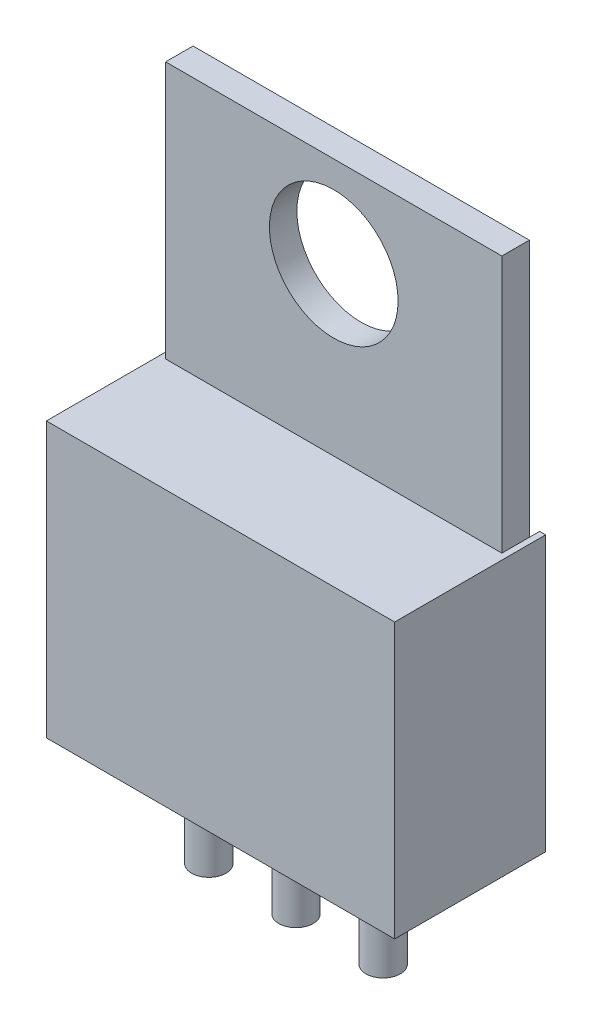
ISO-10303-21;
HEADER;
FILE_DESCRIPTION(('STEP AP214'),'2;1');
FILE_NAME('part.step','',(''),(''),'','','');
FILE_SCHEMA(('AUTOMOTIVE_DESIGN { 1 0 10303 214 1 1 1 1 }'));
ENDSEC;
DATA;
#1=APPLICATION_CONTEXT('core data for automotive mechanical design processes');
#2=APPLICATION_PROTOCOL_DEFINITION('international standard','automotive_design',2000,#1);
#3=PRODUCT_CONTEXT('',#1,'mechanical');
#4=PRODUCT('Part','Part','',(#3));
#5=PRODUCT_RELATED_PRODUCT_CATEGORY('part','',(#4));
#6=PRODUCT_DEFINITION_FORMATION('','',#4);
#7=PRODUCT_DEFINITION_CONTEXT('part definition',#1,'design');
#8=PRODUCT_DEFINITION('design','',#6,#7);
#9=PRODUCT_DEFINITION_SHAPE('','',#8);
#10=(LENGTH_UNIT() NAMED_UNIT(*) SI_UNIT(.MILLI.,.METRE.));
#11=(NAMED_UNIT(*) PLANE_ANGLE_UNIT() SI_UNIT($,.RADIAN.));
#12=(NAMED_UNIT(*) SI_UNIT($,.STERADIAN.) SOLID_ANGLE_UNIT());
#13=UNCERTAINTY_MEASURE_WITH_UNIT(LENGTH_MEASURE(1.E-05),#10,'distance_accuracy_value','');
#14=(GEOMETRIC_REPRESENTATION_CONTEXT(3) GLOBAL_UNCERTAINTY_ASSIGNED_CONTEXT((#13)) GLOBAL_UNIT_ASSIGNED_CONTEXT((#10,
#11,#12)) REPRESENTATION_CONTEXT('',''));
#15=CARTESIAN_POINT('',(0.,0.,0.));
#16=DIRECTION('',(0.,0.,1.));
#17=DIRECTION('',(1.,0.,0.));
#18=AXIS2_PLACEMENT_3D('',#15,#16,#17);
#19=CARTESIAN_POINT('',(0.,15.5,1.1));
#20=DIRECTION('',(0.,-1.,0.));
#21=DIRECTION('',(0.,0.,-1.));
#22=AXIS2_PLACEMENT_3D('',#19,#20,#21);
#23=PLANE('',#22);
#24=DIRECTION('',(1.,0.,0.));
#25=VECTOR('',#24,1.);
#26=CARTESIAN_POINT('',(9.975,15.5,0.3));
#27=LINE('',#26,#25);
#28=CARTESIAN_POINT('',(0.174999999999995,15.5,0.3));
#29=VERTEX_POINT('',#28);
#30=CARTESIAN_POINT('',(9.975,15.5,0.3));
#31=VERTEX_POINT('',#30);
#32=EDGE_CURVE('E195',#29,#31,#27,.T.);
#33=ORIENTED_EDGE('',*,*,#32,.F.);
#34=DIRECTION('',(0.,0.,1.));
#35=VECTOR('',#34,1.);
#36=CARTESIAN_POINT('',(0.174999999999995,15.5,-0.0999999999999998));
#37=LINE('',#36,#35);
#38=CARTESIAN_POINT('',(0.174999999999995,15.5,1.1));
#39=VERTEX_POINT('',#38);
#40=EDGE_CURVE('E214',#29,#39,#37,.T.);
#41=ORIENTED_EDGE('',*,*,#40,.T.);
#42=DIRECTION('',(-1.,0.,0.));
#43=VECTOR('',#42,1.);
#44=CARTESIAN_POINT('',(0.,15.5,1.1));
#45=LINE('',#44,#43);
#46=CARTESIAN_POINT('',(9.975,15.5,1.1));
#47=VERTEX_POINT('',#46);
#48=EDGE_CURVE('E286',#47,#39,#45,.T.);
#49=ORIENTED_EDGE('',*,*,#48,.F.);
#50=DIRECTION('',(0.,0.,1.));
#51=VECTOR('',#50,1.);
#52=CARTESIAN_POINT('',(9.975,15.5,-0.0999999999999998));
#53=LINE('',#52,#51);
#54=EDGE_CURVE('E223',#31,#47,#53,.T.);
#55=ORIENTED_EDGE('',*,*,#54,.F.);
#56=EDGE_LOOP('',(#33,#41,#49,#55));
#57=FACE_BOUND('',#56,.T.);
#58=ADVANCED_FACE('F39',(#57),#23,.F.);
#59=CARTESIAN_POINT('',(5.075,12.85,0.));
#60=DIRECTION('',(0.,0.,1.));
#61=DIRECTION('',(1.,0.,0.));
#62=AXIS2_PLACEMENT_3D('',#59,#60,#61);
#63=CYLINDRICAL_SURFACE('',#62,1.875);
#64=CARTESIAN_POINT('',(5.075,12.85,1.1));
#65=DIRECTION('',(0.,0.,1.));
#66=DIRECTION('',(1.,0.,0.));
#67=AXIS2_PLACEMENT_3D('',#64,#65,#66);
#68=CIRCLE('',#67,1.875);
#69=CARTESIAN_POINT('',(6.94999999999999,12.85,1.1));
#70=VERTEX_POINT('',#69);
#71=EDGE_CURVE('E251',#70,#70,#68,.T.);
#72=ORIENTED_EDGE('',*,*,#71,.T.);
#73=EDGE_LOOP('',(#72));
#74=FACE_BOUND('',#73,.T.);
#75=CARTESIAN_POINT('',(5.075,12.85,0.3));
#76=DIRECTION('',(0.,0.,-1.));
#77=DIRECTION('',(-1.,0.,0.));
#78=AXIS2_PLACEMENT_3D('',#75,#76,#77);
#79=CIRCLE('',#78,1.875);
#80=CARTESIAN_POINT('',(3.2,12.85,0.3));
#81=VERTEX_POINT('',#80);
#82=EDGE_CURVE('E206',#81,#81,#79,.F.);
#83=ORIENTED_EDGE('',*,*,#82,.F.);
#84=EDGE_LOOP('',(#83));
#85=FACE_BOUND('',#84,.T.);
#86=ADVANCED_FACE('F329',(#74,#85),#63,.F.);
#87=CARTESIAN_POINT('',(9.975,15.5,-0.0999999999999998));
#88=DIRECTION('',(-1.,0.,0.));
#89=DIRECTION('',(0.,0.,1.));
#90=AXIS2_PLACEMENT_3D('',#87,#88,#89);
#91=PLANE('',#90);
#92=DIRECTION('',(0.,-1.,0.));
#93=VECTOR('',#92,1.);
#94=CARTESIAN_POINT('',(9.975,15.5,0.3));
#95=LINE('',#94,#93);
#96=CARTESIAN_POINT('',(9.975,8.,0.3));
#97=VERTEX_POINT('',#96);
#98=EDGE_CURVE('E188',#31,#97,#95,.T.);
#99=ORIENTED_EDGE('',*,*,#98,.F.);
#100=ORIENTED_EDGE('',*,*,#54,.T.);
#101=DIRECTION('',(0.,-1.,0.));
#102=VECTOR('',#101,1.);
#103=CARTESIAN_POINT('',(9.975,15.5,1.1));
#104=LINE('',#103,#102);
#105=CARTESIAN_POINT('',(9.975,8.,1.1));
#106=VERTEX_POINT('',#105);
#107=EDGE_CURVE('E217',#47,#106,#104,.T.);
#108=ORIENTED_EDGE('',*,*,#107,.T.);
#109=DIRECTION('',(0.,0.,1.));
#110=VECTOR('',#109,1.);
#111=CARTESIAN_POINT('',(9.975,8.,-0.0999999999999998));
#112=LINE('',#111,#110);
#113=EDGE_CURVE('E222',#97,#106,#112,.T.);
#114=ORIENTED_EDGE('',*,*,#113,.F.);
#115=EDGE_LOOP('',(#99,#100,#108,#114));
#116=FACE_BOUND('',#115,.T.);
#117=ADVANCED_FACE('F323',(#116),#91,.F.);
#118=CARTESIAN_POINT('',(0.174999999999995,15.5,-0.0999999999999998));
#119=DIRECTION('',(1.,0.,0.));
#120=DIRECTION('',(0.,0.,-1.));
#121=AXIS2_PLACEMENT_3D('',#118,#119,#120);
#122=PLANE('',#121);
#123=DIRECTION('',(0.,1.,0.));
#124=VECTOR('',#123,1.);
#125=CARTESIAN_POINT('',(0.174999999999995,15.5,0.3));
#126=LINE('',#125,#124);
#127=CARTESIAN_POINT('',(0.174999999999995,8.,0.3));
#128=VERTEX_POINT('',#127);
#129=EDGE_CURVE('E11',#128,#29,#126,.T.);
#130=ORIENTED_EDGE('',*,*,#129,.F.);
#131=DIRECTION('',(0.,0.,1.));
#132=VECTOR('',#131,1.);
#133=CARTESIAN_POINT('',(0.174999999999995,8.,-0.0999999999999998));
#134=LINE('',#133,#132);
#135=CARTESIAN_POINT('',(0.174999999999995,8.,1.1));
#136=VERTEX_POINT('',#135);
#137=EDGE_CURVE('E218',#128,#136,#134,.T.);
#138=ORIENTED_EDGE('',*,*,#137,.T.);
#139=DIRECTION('',(0.,1.,0.));
#140=VECTOR('',#139,1.);
#141=CARTESIAN_POINT('',(0.174999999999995,15.5,1.1));
#142=LINE('',#141,#140);
#143=EDGE_CURVE('E211',#136,#39,#142,.T.);
#144=ORIENTED_EDGE('',*,*,#143,.T.);
#145=ORIENTED_EDGE('',*,*,#40,.F.);
#146=EDGE_LOOP('',(#130,#138,#144,#145));
#147=FACE_BOUND('',#146,.T.);
#148=ADVANCED_FACE('F315',(#147),#122,.F.);
#149=CARTESIAN_POINT('',(0.,0.,1.1));
#150=DIRECTION('',(0.,1.,0.));
#151=DIRECTION('',(0.,0.,1.));
#152=AXIS2_PLACEMENT_3D('',#149,#150,#151);
#153=PLANE('',#152);
#154=CARTESIAN_POINT('',(7.615,0.,2.2));
#155=DIRECTION('',(0.,1.,0.));
#156=DIRECTION('',(0.,0.,1.));
#157=AXIS2_PLACEMENT_3D('',#154,#155,#156);
#158=CIRCLE('',#157,0.500000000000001);
#159=CARTESIAN_POINT('',(7.615,0.,2.7));
#160=VERTEX_POINT('',#159);
#161=EDGE_CURVE('E303',#160,#160,#158,.F.);
#162=ORIENTED_EDGE('',*,*,#161,.F.);
#163=EDGE_LOOP('',(#162));
#164=FACE_BOUND('',#163,.T.);
#165=DIRECTION('',(1.,0.,0.));
#166=VECTOR('',#165,1.);
#167=CARTESIAN_POINT('',(0.,0.,0.));
#168=LINE('',#167,#166);
#169=CARTESIAN_POINT('',(0.,0.,0.));
#170=VERTEX_POINT('',#169);
#171=CARTESIAN_POINT('',(10.15,0.,0.));
#172=VERTEX_POINT('',#171);
#173=EDGE_CURVE('E278',#170,#172,#168,.T.);
#174=ORIENTED_EDGE('',*,*,#173,.T.);
#175=DIRECTION('',(0.,0.,-1.));
#176=VECTOR('',#175,1.);
#177=CARTESIAN_POINT('',(10.15,0.,1.1));
#178=LINE('',#177,#176);
#179=CARTESIAN_POINT('',(10.15,0.,4.4));
#180=VERTEX_POINT('',#179);
#181=EDGE_CURVE('E290',#180,#172,#178,.T.);
#182=ORIENTED_EDGE('',*,*,#181,.F.);
#183=DIRECTION('',(1.,0.,0.));
#184=VECTOR('',#183,1.);
#185=CARTESIAN_POINT('',(0.,0.,4.4));
#186=LINE('',#185,#184);
#187=CARTESIAN_POINT('',(0.,0.,4.4));
#188=VERTEX_POINT('',#187);
#189=EDGE_CURVE('E241',#188,#180,#186,.T.);
#190=ORIENTED_EDGE('',*,*,#189,.F.);
#191=DIRECTION('',(0.,0.,-1.));
#192=VECTOR('',#191,1.);
#193=CARTESIAN_POINT('',(0.,0.,1.1));
#194=LINE('',#193,#192);
#195=EDGE_CURVE('E293',#188,#170,#194,.T.);
#196=ORIENTED_EDGE('',*,*,#195,.T.);
#197=EDGE_LOOP('',(#174,#182,#190,#196));
#198=FACE_BOUND('',#197,.T.);
#199=CARTESIAN_POINT('',(5.075,0.,2.2));
#200=DIRECTION('',(0.,1.,0.));
#201=DIRECTION('',(0.,0.,1.));
#202=AXIS2_PLACEMENT_3D('',#199,#200,#201);
#203=CIRCLE('',#202,0.5);
#204=CARTESIAN_POINT('',(5.075,0.,2.7));
#205=VERTEX_POINT('',#204);
#206=EDGE_CURVE('E295',#205,#205,#203,.F.);
#207=ORIENTED_EDGE('',*,*,#206,.F.);
#208=EDGE_LOOP('',(#207));
#209=FACE_BOUND('',#208,.T.);
#210=CARTESIAN_POINT('',(2.535,0.,2.2));
#211=DIRECTION('',(0.,1.,0.));
#212=DIRECTION('',(0.,0.,1.));
#213=AXIS2_PLACEMENT_3D('',#210,#211,#212);
#214=CIRCLE('',#213,0.5);
#215=CARTESIAN_POINT('',(2.535,0.,2.7));
#216=VERTEX_POINT('',#215);
#217=EDGE_CURVE('E257',#216,#216,#214,.F.);
#218=ORIENTED_EDGE('',*,*,#217,.F.);
#219=EDGE_LOOP('',(#218));
#220=FACE_BOUND('',#219,.T.);
#221=ADVANCED_FACE('F312',(#164,#198,#209,#220),#153,.F.);
#222=CARTESIAN_POINT('',(0.,15.5,1.1));
#223=DIRECTION('',(0.,0.,-1.));
#224=DIRECTION('',(-1.,0.,0.));
#225=AXIS2_PLACEMENT_3D('',#222,#223,#224);
#226=PLANE('',#225);
#227=ORIENTED_EDGE('',*,*,#71,.F.);
#228=EDGE_LOOP('',(#227));
#229=FACE_BOUND('',#228,.T.);
#230=ORIENTED_EDGE('',*,*,#48,.T.);
#231=ORIENTED_EDGE('',*,*,#143,.F.);
#232=DIRECTION('',(-1.,0.,0.));
#233=VECTOR('',#232,1.);
#234=CARTESIAN_POINT('',(0.,8.,1.1));
#235=LINE('',#234,#233);
#236=EDGE_CURVE('E237',#106,#136,#235,.T.);
#237=ORIENTED_EDGE('',*,*,#236,.F.);
#238=ORIENTED_EDGE('',*,*,#107,.F.);
#239=EDGE_LOOP('',(#230,#231,#237,#238));
#240=FACE_BOUND('',#239,.T.);
#241=ADVANCED_FACE('F314',(#229,#240),#226,.F.);
#242=CARTESIAN_POINT('',(0.,0.,1.1));
#243=DIRECTION('',(1.,0.,0.));
#244=DIRECTION('',(0.,1.,0.));
#245=AXIS2_PLACEMENT_3D('',#242,#243,#244);
#246=PLANE('',#245);
#247=DIRECTION('',(0.,0.,-1.));
#248=VECTOR('',#247,1.);
#249=CARTESIAN_POINT('',(0.,8.,4.4));
#250=LINE('',#249,#248);
#251=CARTESIAN_POINT('',(0.,8.,4.4));
#252=VERTEX_POINT('',#251);
#253=CARTESIAN_POINT('',(0.,8.,0.));
#254=VERTEX_POINT('',#253);
#255=EDGE_CURVE('E248',#252,#254,#250,.T.);
#256=ORIENTED_EDGE('',*,*,#255,.T.);
#257=DIRECTION('',(0.,-1.,0.));
#258=VECTOR('',#257,1.);
#259=CARTESIAN_POINT('',(0.,0.,0.));
#260=LINE('',#259,#258);
#261=EDGE_CURVE('E274',#254,#170,#260,.T.);
#262=ORIENTED_EDGE('',*,*,#261,.T.);
#263=ORIENTED_EDGE('',*,*,#195,.F.);
#264=DIRECTION('',(0.,-1.,0.));
#265=VECTOR('',#264,1.);
#266=CARTESIAN_POINT('',(0.,0.,4.4));
#267=LINE('',#266,#265);
#268=EDGE_CURVE('E238',#252,#188,#267,.T.);
#269=ORIENTED_EDGE('',*,*,#268,.F.);
#270=EDGE_LOOP('',(#256,#262,#263,#269));
#271=FACE_BOUND('',#270,.T.);
#272=ADVANCED_FACE('F41',(#271),#246,.F.);
#273=CARTESIAN_POINT('',(10.15,0.,1.1));
#274=DIRECTION('',(-1.,0.,0.));
#275=DIRECTION('',(0.,-1.,0.));
#276=AXIS2_PLACEMENT_3D('',#273,#274,#275);
#277=PLANE('',#276);
#278=DIRECTION('',(0.,1.,0.));
#279=VECTOR('',#278,1.);
#280=CARTESIAN_POINT('',(10.15,0.,0.));
#281=LINE('',#280,#279);
#282=CARTESIAN_POINT('',(10.15,8.,0.));
#283=VERTEX_POINT('',#282);
#284=EDGE_CURVE('E282',#172,#283,#281,.T.);
#285=ORIENTED_EDGE('',*,*,#284,.T.);
#286=DIRECTION('',(0.,0.,-1.));
#287=VECTOR('',#286,1.);
#288=CARTESIAN_POINT('',(10.15,8.,4.4));
#289=LINE('',#288,#287);
#290=CARTESIAN_POINT('',(10.15,8.,4.4));
#291=VERTEX_POINT('',#290);
#292=EDGE_CURVE('E285',#291,#283,#289,.T.);
#293=ORIENTED_EDGE('',*,*,#292,.F.);
#294=DIRECTION('',(0.,1.,0.));
#295=VECTOR('',#294,1.);
#296=CARTESIAN_POINT('',(10.15,0.,4.4));
#297=LINE('',#296,#295);
#298=EDGE_CURVE('E244',#180,#291,#297,.T.);
#299=ORIENTED_EDGE('',*,*,#298,.F.);
#300=ORIENTED_EDGE('',*,*,#181,.T.);
#301=EDGE_LOOP('',(#285,#293,#299,#300));
#302=FACE_BOUND('',#301,.T.);
#303=ADVANCED_FACE('F339',(#302),#277,.F.);
#304=CARTESIAN_POINT('',(0.,15.5,0.));
#305=DIRECTION('',(0.,0.,-1.));
#306=DIRECTION('',(-1.,0.,0.));
#307=AXIS2_PLACEMENT_3D('',#304,#305,#306);
#308=PLANE('',#307);
#309=DIRECTION('',(0.,-1.,0.));
#310=VECTOR('',#309,1.);
#311=CARTESIAN_POINT('',(9.975,15.5,0.));
#312=LINE('',#311,#310);
#313=CARTESIAN_POINT('',(9.975,8.,0.));
#314=VERTEX_POINT('',#313);
#315=CARTESIAN_POINT('',(9.975,2.,0.));
#316=VERTEX_POINT('',#315);
#317=EDGE_CURVE('E184',#314,#316,#312,.T.);
#318=ORIENTED_EDGE('',*,*,#317,.F.);
#319=DIRECTION('',(-1.,0.,0.));
#320=VECTOR('',#319,1.);
#321=CARTESIAN_POINT('',(0.,8.,0.));
#322=LINE('',#321,#320);
#323=EDGE_CURVE('E259',#283,#314,#322,.T.);
#324=ORIENTED_EDGE('',*,*,#323,.F.);
#325=ORIENTED_EDGE('',*,*,#284,.F.);
#326=ORIENTED_EDGE('',*,*,#173,.F.);
#327=ORIENTED_EDGE('',*,*,#261,.F.);
#328=DIRECTION('',(-1.,0.,0.));
#329=VECTOR('',#328,1.);
#330=CARTESIAN_POINT('',(0.,8.,0.));
#331=LINE('',#330,#329);
#332=CARTESIAN_POINT('',(0.174999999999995,8.,0.));
#333=VERTEX_POINT('',#332);
#334=EDGE_CURVE('E47',#333,#254,#331,.T.);
#335=ORIENTED_EDGE('',*,*,#334,.F.);
#336=DIRECTION('',(0.,1.,0.));
#337=VECTOR('',#336,1.);
#338=CARTESIAN_POINT('',(0.174999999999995,15.5,0.));
#339=LINE('',#338,#337);
#340=CARTESIAN_POINT('',(0.174999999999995,2.,0.));
#341=VERTEX_POINT('',#340);
#342=EDGE_CURVE('E202',#341,#333,#339,.T.);
#343=ORIENTED_EDGE('',*,*,#342,.F.);
#344=DIRECTION('',(-1.,0.,0.));
#345=VECTOR('',#344,1.);
#346=CARTESIAN_POINT('',(9.975,2.,0.));
#347=LINE('',#346,#345);
#348=EDGE_CURVE('E199',#316,#341,#347,.T.);
#349=ORIENTED_EDGE('',*,*,#348,.F.);
#350=EDGE_LOOP('',(#318,#324,#325,#326,#327,#335,#343,#349));
#351=FACE_BOUND('',#350,.T.);
#352=ADVANCED_FACE('F276',(#351),#308,.T.);
#353=CARTESIAN_POINT('',(0.,8.,4.4));
#354=DIRECTION('',(0.,-1.,0.));
#355=DIRECTION('',(0.,0.,-1.));
#356=AXIS2_PLACEMENT_3D('',#353,#354,#355);
#357=PLANE('',#356);
#358=ORIENTED_EDGE('',*,*,#292,.T.);
#359=ORIENTED_EDGE('',*,*,#323,.T.);
#360=EDGE_CURVE('E226',#314,#97,#112,.T.);
#361=ORIENTED_EDGE('',*,*,#360,.T.);
#362=ORIENTED_EDGE('',*,*,#113,.T.);
#363=ORIENTED_EDGE('',*,*,#236,.T.);
#364=ORIENTED_EDGE('',*,*,#137,.F.);
#365=EDGE_CURVE('E215',#333,#128,#134,.T.);
#366=ORIENTED_EDGE('',*,*,#365,.F.);
#367=ORIENTED_EDGE('',*,*,#334,.T.);
#368=ORIENTED_EDGE('',*,*,#255,.F.);
#369=DIRECTION('',(-1.,0.,0.));
#370=VECTOR('',#369,1.);
#371=CARTESIAN_POINT('',(0.,8.,4.4));
#372=LINE('',#371,#370);
#373=EDGE_CURVE('E246',#291,#252,#372,.T.);
#374=ORIENTED_EDGE('',*,*,#373,.F.);
#375=EDGE_LOOP('',(#358,#359,#361,#362,#363,#364,#366,#367,#368,#374));
#376=FACE_BOUND('',#375,.T.);
#377=ADVANCED_FACE('F267',(#376),#357,.F.);
#378=CARTESIAN_POINT('',(0.,8.,4.4));
#379=DIRECTION('',(0.,0.,-1.));
#380=DIRECTION('',(-1.,0.,0.));
#381=AXIS2_PLACEMENT_3D('',#378,#379,#380);
#382=PLANE('',#381);
#383=ORIENTED_EDGE('',*,*,#268,.T.);
#384=ORIENTED_EDGE('',*,*,#189,.T.);
#385=ORIENTED_EDGE('',*,*,#298,.T.);
#386=ORIENTED_EDGE('',*,*,#373,.T.);
#387=EDGE_LOOP('',(#383,#384,#385,#386));
#388=FACE_BOUND('',#387,.T.);
#389=ADVANCED_FACE('F352',(#388),#382,.F.);
#390=CARTESIAN_POINT('',(5.075,-3.,2.2));
#391=DIRECTION('',(0.,1.,0.));
#392=DIRECTION('',(0.,0.,1.));
#393=AXIS2_PLACEMENT_3D('',#390,#391,#392);
#394=CYLINDRICAL_SURFACE('',#393,0.5);
#395=CARTESIAN_POINT('',(5.075,-3.,2.2));
#396=DIRECTION('',(0.,-1.,0.));
#397=DIRECTION('',(0.,0.,-1.));
#398=AXIS2_PLACEMENT_3D('',#395,#396,#397);
#399=CIRCLE('',#398,0.5);
#400=CARTESIAN_POINT('',(5.075,-3.,1.7));
#401=VERTEX_POINT('',#400);
#402=EDGE_CURVE('E234',#401,#401,#399,.T.);
#403=ORIENTED_EDGE('',*,*,#402,.F.);
#404=EDGE_LOOP('',(#403));
#405=FACE_BOUND('',#404,.T.);
#406=ORIENTED_EDGE('',*,*,#206,.T.);
#407=EDGE_LOOP('',(#406));
#408=FACE_BOUND('',#407,.T.);
#409=ADVANCED_FACE('F357',(#405,#408),#394,.T.);
#410=CARTESIAN_POINT('',(5.075,-3.,2.2));
#411=DIRECTION('',(0.,-1.,0.));
#412=DIRECTION('',(0.,0.,-1.));
#413=AXIS2_PLACEMENT_3D('',#410,#411,#412);
#414=PLANE('',#413);
#415=ORIENTED_EDGE('',*,*,#402,.T.);
#416=EDGE_LOOP('',(#415));
#417=FACE_BOUND('',#416,.T.);
#418=ADVANCED_FACE('F359',(#417),#414,.T.);
#419=CARTESIAN_POINT('',(7.615,-3.,2.2));
#420=DIRECTION('',(0.,1.,0.));
#421=DIRECTION('',(0.,0.,1.));
#422=AXIS2_PLACEMENT_3D('',#419,#420,#421);
#423=CYLINDRICAL_SURFACE('',#422,0.500000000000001);
#424=CARTESIAN_POINT('',(7.615,-3.,2.2));
#425=DIRECTION('',(0.,-1.,0.));
#426=DIRECTION('',(0.,0.,-1.));
#427=AXIS2_PLACEMENT_3D('',#424,#425,#426);
#428=CIRCLE('',#427,0.500000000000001);
#429=CARTESIAN_POINT('',(7.615,-3.,1.7));
#430=VERTEX_POINT('',#429);
#431=EDGE_CURVE('E231',#430,#430,#428,.T.);
#432=ORIENTED_EDGE('',*,*,#431,.F.);
#433=EDGE_LOOP('',(#432));
#434=FACE_BOUND('',#433,.T.);
#435=ORIENTED_EDGE('',*,*,#161,.T.);
#436=EDGE_LOOP('',(#435));
#437=FACE_BOUND('',#436,.T.);
#438=ADVANCED_FACE('F366',(#434,#437),#423,.T.);
#439=CARTESIAN_POINT('',(7.615,-3.,2.2));
#440=DIRECTION('',(0.,-1.,0.));
#441=DIRECTION('',(0.,0.,-1.));
#442=AXIS2_PLACEMENT_3D('',#439,#440,#441);
#443=PLANE('',#442);
#444=ORIENTED_EDGE('',*,*,#431,.T.);
#445=EDGE_LOOP('',(#444));
#446=FACE_BOUND('',#445,.T.);
#447=ADVANCED_FACE('F525',(#446),#443,.T.);
#448=CARTESIAN_POINT('',(2.535,-3.,2.2));
#449=DIRECTION('',(0.,1.,0.));
#450=DIRECTION('',(0.,0.,1.));
#451=AXIS2_PLACEMENT_3D('',#448,#449,#450);
#452=CYLINDRICAL_SURFACE('',#451,0.5);
#453=CARTESIAN_POINT('',(2.535,-3.,2.2));
#454=DIRECTION('',(0.,-1.,0.));
#455=DIRECTION('',(0.,0.,-1.));
#456=AXIS2_PLACEMENT_3D('',#453,#454,#455);
#457=CIRCLE('',#456,0.5);
#458=CARTESIAN_POINT('',(2.535,-3.,1.7));
#459=VERTEX_POINT('',#458);
#460=EDGE_CURVE('E225',#459,#459,#457,.T.);
#461=ORIENTED_EDGE('',*,*,#460,.F.);
#462=EDGE_LOOP('',(#461));
#463=FACE_BOUND('',#462,.T.);
#464=ORIENTED_EDGE('',*,*,#217,.T.);
#465=EDGE_LOOP('',(#464));
#466=FACE_BOUND('',#465,.T.);
#467=ADVANCED_FACE('F310',(#463,#466),#452,.T.);
#468=CARTESIAN_POINT('',(2.535,-3.,2.2));
#469=DIRECTION('',(0.,-1.,0.));
#470=DIRECTION('',(0.,0.,-1.));
#471=AXIS2_PLACEMENT_3D('',#468,#469,#470);
#472=PLANE('',#471);
#473=ORIENTED_EDGE('',*,*,#460,.T.);
#474=EDGE_LOOP('',(#473));
#475=FACE_BOUND('',#474,.T.);
#476=ADVANCED_FACE('F416',(#475),#472,.T.);
#477=CARTESIAN_POINT('',(9.975,15.5,0.3));
#478=DIRECTION('',(1.,0.,0.));
#479=DIRECTION('',(0.,0.,-1.));
#480=AXIS2_PLACEMENT_3D('',#477,#478,#479);
#481=PLANE('',#480);
#482=ORIENTED_EDGE('',*,*,#317,.T.);
#483=DIRECTION('',(0.,0.,-1.));
#484=VECTOR('',#483,1.);
#485=CARTESIAN_POINT('',(9.975,2.,0.3));
#486=LINE('',#485,#484);
#487=CARTESIAN_POINT('',(9.975,2.,0.3));
#488=VERTEX_POINT('',#487);
#489=EDGE_CURVE('E197',#488,#316,#486,.T.);
#490=ORIENTED_EDGE('',*,*,#489,.F.);
#491=EDGE_CURVE('E192',#97,#488,#95,.T.);
#492=ORIENTED_EDGE('',*,*,#491,.F.);
#493=ORIENTED_EDGE('',*,*,#360,.F.);
#494=EDGE_LOOP('',(#482,#490,#492,#493));
#495=FACE_BOUND('',#494,.T.);
#496=ADVANCED_FACE('F404',(#495),#481,.F.);
#497=CARTESIAN_POINT('',(0.174999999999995,15.5,0.3));
#498=DIRECTION('',(-1.,0.,0.));
#499=DIRECTION('',(0.,0.,1.));
#500=AXIS2_PLACEMENT_3D('',#497,#498,#499);
#501=PLANE('',#500);
#502=DIRECTION('',(0.,1.,0.));
#503=VECTOR('',#502,1.);
#504=CARTESIAN_POINT('',(0.174999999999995,15.5,0.3));
#505=LINE('',#504,#503);
#506=CARTESIAN_POINT('',(0.174999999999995,2.,0.3));
#507=VERTEX_POINT('',#506);
#508=EDGE_CURVE('E61',#507,#128,#505,.T.);
#509=ORIENTED_EDGE('',*,*,#508,.F.);
#510=DIRECTION('',(0.,0.,-1.));
#511=VECTOR('',#510,1.);
#512=CARTESIAN_POINT('',(0.174999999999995,2.,0.3));
#513=LINE('',#512,#511);
#514=EDGE_CURVE('E204',#507,#341,#513,.T.);
#515=ORIENTED_EDGE('',*,*,#514,.T.);
#516=ORIENTED_EDGE('',*,*,#342,.T.);
#517=ORIENTED_EDGE('',*,*,#365,.T.);
#518=EDGE_LOOP('',(#509,#515,#516,#517));
#519=FACE_BOUND('',#518,.T.);
#520=ADVANCED_FACE('F399',(#519),#501,.F.);
#521=CARTESIAN_POINT('',(9.975,2.,0.3));
#522=DIRECTION('',(0.,0.,-1.));
#523=DIRECTION('',(-1.,0.,0.));
#524=AXIS2_PLACEMENT_3D('',#521,#522,#523);
#525=PLANE('',#524);
#526=ORIENTED_EDGE('',*,*,#98,.T.);
#527=ORIENTED_EDGE('',*,*,#491,.T.);
#528=DIRECTION('',(-1.,0.,0.));
#529=VECTOR('',#528,1.);
#530=CARTESIAN_POINT('',(9.975,2.,0.3));
#531=LINE('',#530,#529);
#532=EDGE_CURVE('E191',#488,#507,#531,.T.);
#533=ORIENTED_EDGE('',*,*,#532,.T.);
#534=ORIENTED_EDGE('',*,*,#508,.T.);
#535=ORIENTED_EDGE('',*,*,#129,.T.);
#536=ORIENTED_EDGE('',*,*,#32,.T.);
#537=EDGE_LOOP('',(#526,#527,#533,#534,#535,#536));
#538=FACE_BOUND('',#537,.T.);
#539=DIRECTION('',(1.,0.,0.));
#540=VECTOR('',#539,1.);
#541=CARTESIAN_POINT('',(3.2,8.,0.3));
#542=LINE('',#541,#540);
#543=CARTESIAN_POINT('',(3.2,8.,0.3));
#544=VERTEX_POINT('',#543);
#545=CARTESIAN_POINT('',(6.94999999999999,8.,0.3));
#546=VERTEX_POINT('',#545);
#547=EDGE_CURVE('E158',#544,#546,#542,.T.);
#548=ORIENTED_EDGE('',*,*,#547,.F.);
#549=DIRECTION('',(0.,1.,0.));
#550=VECTOR('',#549,1.);
#551=CARTESIAN_POINT('',(3.2,8.,0.3));
#552=LINE('',#551,#550);
#553=CARTESIAN_POINT('',(3.2,7.,0.3));
#554=VERTEX_POINT('',#553);
#555=EDGE_CURVE('E168',#554,#544,#552,.T.);
#556=ORIENTED_EDGE('',*,*,#555,.F.);
#557=DIRECTION('',(-1.,0.,0.));
#558=VECTOR('',#557,1.);
#559=CARTESIAN_POINT('',(6.94999999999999,7.,0.3));
#560=LINE('',#559,#558);
#561=CARTESIAN_POINT('',(6.94999999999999,7.,0.3));
#562=VERTEX_POINT('',#561);
#563=EDGE_CURVE('E150',#562,#554,#560,.T.);
#564=ORIENTED_EDGE('',*,*,#563,.F.);
#565=DIRECTION('',(0.,-1.,0.));
#566=VECTOR('',#565,1.);
#567=CARTESIAN_POINT('',(6.94999999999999,8.,0.3));
#568=LINE('',#567,#566);
#569=EDGE_CURVE('E165',#546,#562,#568,.T.);
#570=ORIENTED_EDGE('',*,*,#569,.F.);
#571=EDGE_LOOP('',(#548,#556,#564,#570));
#572=FACE_BOUND('',#571,.T.);
#573=ORIENTED_EDGE('',*,*,#82,.T.);
#574=EDGE_LOOP('',(#573));
#575=FACE_BOUND('',#574,.T.);
#576=ADVANCED_FACE('F163',(#538,#572,#575),#525,.T.);
#577=CARTESIAN_POINT('',(9.975,2.,0.3));
#578=DIRECTION('',(0.,-1.,0.));
#579=DIRECTION('',(0.,0.,-1.));
#580=AXIS2_PLACEMENT_3D('',#577,#578,#579);
#581=PLANE('',#580);
#582=ORIENTED_EDGE('',*,*,#348,.T.);
#583=ORIENTED_EDGE('',*,*,#514,.F.);
#584=ORIENTED_EDGE('',*,*,#532,.F.);
#585=ORIENTED_EDGE('',*,*,#489,.T.);
#586=EDGE_LOOP('',(#582,#583,#584,#585));
#587=FACE_BOUND('',#586,.T.);
#588=ADVANCED_FACE('F423',(#587),#581,.F.);
#589=CARTESIAN_POINT('',(6.94999999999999,8.,0.3));
#590=DIRECTION('',(1.,0.,0.));
#591=DIRECTION('',(0.,1.,0.));
#592=AXIS2_PLACEMENT_3D('',#589,#590,#591);
#593=PLANE('',#592);
#594=DIRECTION('',(0.,-1.,0.));
#595=VECTOR('',#594,1.);
#596=CARTESIAN_POINT('',(6.94999999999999,8.,0.));
#597=LINE('',#596,#595);
#598=CARTESIAN_POINT('',(6.94999999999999,8.,0.));
#599=VERTEX_POINT('',#598);
#600=CARTESIAN_POINT('',(6.94999999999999,7.,0.));
#601=VERTEX_POINT('',#600);
#602=EDGE_CURVE('E179',#599,#601,#597,.T.);
#603=ORIENTED_EDGE('',*,*,#602,.F.);
#604=DIRECTION('',(0.,0.,-1.));
#605=VECTOR('',#604,1.);
#606=CARTESIAN_POINT('',(6.94999999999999,8.,0.3));
#607=LINE('',#606,#605);
#608=EDGE_CURVE('E171',#546,#599,#607,.T.);
#609=ORIENTED_EDGE('',*,*,#608,.F.);
#610=ORIENTED_EDGE('',*,*,#569,.T.);
#611=DIRECTION('',(0.,0.,-1.));
#612=VECTOR('',#611,1.);
#613=CARTESIAN_POINT('',(6.94999999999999,7.,0.3));
#614=LINE('',#613,#612);
#615=EDGE_CURVE('E147',#562,#601,#614,.T.);
#616=ORIENTED_EDGE('',*,*,#615,.T.);
#617=EDGE_LOOP('',(#603,#609,#610,#616));
#618=FACE_BOUND('',#617,.T.);
#619=ADVANCED_FACE('F170',(#618),#593,.T.);
#620=CARTESIAN_POINT('',(3.2,8.,0.3));
#621=DIRECTION('',(0.,1.,0.));
#622=DIRECTION('',(0.,0.,1.));
#623=AXIS2_PLACEMENT_3D('',#620,#621,#622);
#624=PLANE('',#623);
#625=DIRECTION('',(1.,0.,0.));
#626=VECTOR('',#625,1.);
#627=CARTESIAN_POINT('',(3.2,8.,0.));
#628=LINE('',#627,#626);
#629=CARTESIAN_POINT('',(3.2,8.,0.));
#630=VERTEX_POINT('',#629);
#631=EDGE_CURVE('E172',#630,#599,#628,.T.);
#632=ORIENTED_EDGE('',*,*,#631,.F.);
#633=DIRECTION('',(0.,0.,-1.));
#634=VECTOR('',#633,1.);
#635=CARTESIAN_POINT('',(3.2,8.,0.3));
#636=LINE('',#635,#634);
#637=EDGE_CURVE('E185',#544,#630,#636,.T.);
#638=ORIENTED_EDGE('',*,*,#637,.F.);
#639=ORIENTED_EDGE('',*,*,#547,.T.);
#640=ORIENTED_EDGE('',*,*,#608,.T.);
#641=EDGE_LOOP('',(#632,#638,#639,#640));
#642=FACE_BOUND('',#641,.T.);
#643=ADVANCED_FACE('F496',(#642),#624,.T.);
#644=CARTESIAN_POINT('',(3.2,8.,0.3));
#645=DIRECTION('',(-1.,0.,0.));
#646=DIRECTION('',(0.,-1.,0.));
#647=AXIS2_PLACEMENT_3D('',#644,#645,#646);
#648=PLANE('',#647);
#649=DIRECTION('',(0.,1.,0.));
#650=VECTOR('',#649,1.);
#651=CARTESIAN_POINT('',(3.2,8.,0.));
#652=LINE('',#651,#650);
#653=CARTESIAN_POINT('',(3.2,7.,0.));
#654=VERTEX_POINT('',#653);
#655=EDGE_CURVE('E54',#654,#630,#652,.T.);
#656=ORIENTED_EDGE('',*,*,#655,.F.);
#657=DIRECTION('',(0.,0.,-1.));
#658=VECTOR('',#657,1.);
#659=CARTESIAN_POINT('',(3.2,7.,0.3));
#660=LINE('',#659,#658);
#661=EDGE_CURVE('E157',#554,#654,#660,.T.);
#662=ORIENTED_EDGE('',*,*,#661,.F.);
#663=ORIENTED_EDGE('',*,*,#555,.T.);
#664=ORIENTED_EDGE('',*,*,#637,.T.);
#665=EDGE_LOOP('',(#656,#662,#663,#664));
#666=FACE_BOUND('',#665,.T.);
#667=ADVANCED_FACE('F485',(#666),#648,.T.);
#668=CARTESIAN_POINT('',(6.94999999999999,7.,0.3));
#669=DIRECTION('',(0.,-1.,0.));
#670=DIRECTION('',(0.,0.,-1.));
#671=AXIS2_PLACEMENT_3D('',#668,#669,#670);
#672=PLANE('',#671);
#673=DIRECTION('',(-1.,0.,0.));
#674=VECTOR('',#673,1.);
#675=CARTESIAN_POINT('',(6.94999999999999,7.,0.));
#676=LINE('',#675,#674);
#677=EDGE_CURVE('E152',#601,#654,#676,.T.);
#678=ORIENTED_EDGE('',*,*,#677,.F.);
#679=ORIENTED_EDGE('',*,*,#615,.F.);
#680=ORIENTED_EDGE('',*,*,#563,.T.);
#681=ORIENTED_EDGE('',*,*,#661,.T.);
#682=EDGE_LOOP('',(#678,#679,#680,#681));
#683=FACE_BOUND('',#682,.T.);
#684=ADVANCED_FACE('F149',(#683),#672,.T.);
#685=ORIENTED_EDGE('',*,*,#631,.T.);
#686=ORIENTED_EDGE('',*,*,#602,.T.);
#687=ORIENTED_EDGE('',*,*,#677,.T.);
#688=ORIENTED_EDGE('',*,*,#655,.T.);
#689=EDGE_LOOP('',(#685,#686,#687,#688));
#690=FACE_BOUND('',#689,.T.);
#691=ADVANCED_FACE('F346',(#690),#308,.T.);
#692=CLOSED_SHELL('',(#58,#86,#117,#148,#221,#241,#272,#303,#352,#377,#389,#409,#418,#438,#447,
#467,#476,#496,#520,#576,#588,#619,#643,#667,#684,#691));
#693=MANIFOLD_SOLID_BREP('B2',#692);
#694=ADVANCED_BREP_SHAPE_REPRESENTATION('',(#18,#693),#14);
#695=SHAPE_DEFINITION_REPRESENTATION(#9,#694);
ENDSEC;
END-ISO-10303-21;
